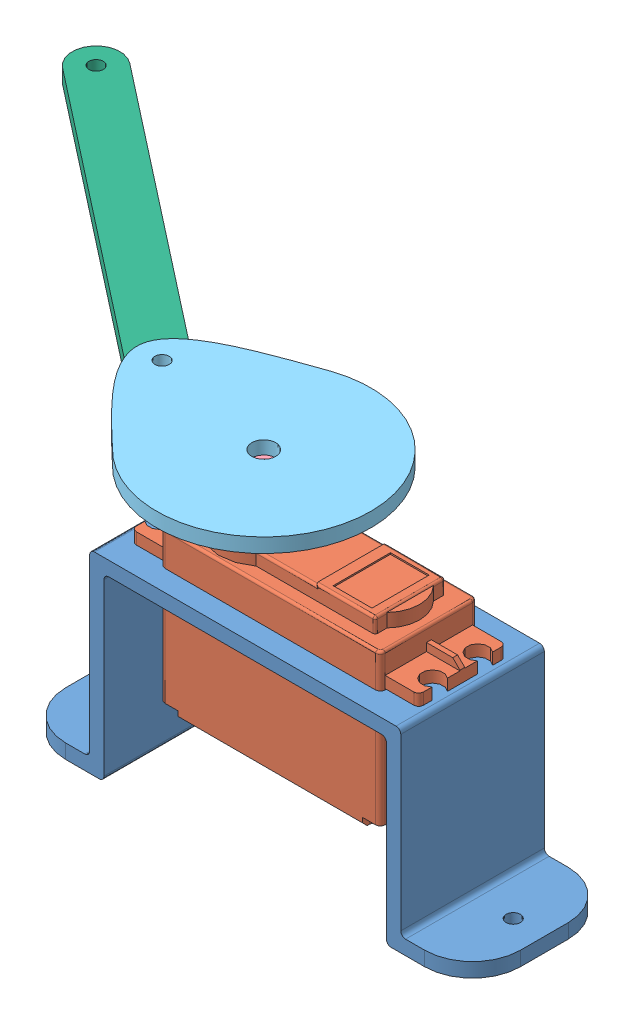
SolidWorks assembly Ass_servo_moteur.SLDASM, configuration Défaut (file format 3800). Lengths in mm.
Overall size (154.95 62.26 88.21).
7 component instances, 6 part files, 6 mates.
Components (placement in the parent):
- support_servo_moteur-1: support_servo_moteur.SLDPRT [Défaut] at (-99.5441 -25.3592 -15) size (95 40.56 30)
- SERVOMOTEUR-1: SERVOMOTEUR.SLDASM [Default] at (-40.8775 -5.6297 0.4339) x (0 0 -1) z (0 1 0) size (26.65 60 45.35)
  - CORPS SERVOMOT-1: CORPS SERVOMOT.SLDPRT [Default] at (10.0784 1.8594 -6.5815) size (20.25 60 38.35)
  - AXE SERVO-1: AXE SERVO.SLDPRT [Default] at (-0.0466 21.8105 26.7685) size (3 3 10)
  - VOLANT SERVO-1: VOLANT SERVO.SLDPRT [Default] at (-0.0466 21.8105 36.7685) x (0.993118 0.117118 0) z (0 0 -1) size (24 24 5.6)
- mecanisme_disque-1: mecanisme_disque.SLDPRT [Défaut] at (-62.688 33.8985 0.4805) x (0.979458 0 0.201651) z (0 -1 0) size (55 44.73 3)
- mecanisme_bras-1: mecanisme_bras.SLDPRT [Défaut] at (-159.4979 28.1198 -53.4315) x (0.787908 0 0.615793) z (0 1 0) size (90 10 3)
Mates (geometry in assembly coordinates):
- Parallèle1: parallel anti-aligned: plane of support_servo_moteur-1 through (-81.5441 -25.3592 15) normal (1 0 0); plane of SERVOMOTEUR-1/CORPS SERVOMOT-1 through (-74.198 19.3388 10.6055) normal (-1 0 0)
- Parallèle2: parallel aligned: plane of SERVOMOTEUR-1/CORPS SERVOMOT-1 through (-74.198 19.3388 10.6055) normal (0 0 1); line of support_servo_moteur-1
- Parallèle3: parallel aligned: plane of SERVOMOTEUR-1/CORPS SERVOMOT-1 through (-74.198 19.3388 10.6055) normal (0 0 1); plane of support_servo_moteur-1 through (-4.5441 -28.3592 15) normal (0 0 1)
- Parallèle4: parallel anti-aligned: plane of SERVOMOTEUR-1/VOLANT SERVO-1 through (-62.688 31.1388 0.4805) normal (0 1 0); plane of mecanisme_disque-1 through (-94.4397 30.8985 -6.6088) normal (0 -1 0)
- Coaxiale1: concentric anti-aligned: circle of SERVOMOTEUR-1/VOLANT SERVO-1; circle of mecanisme_disque-1
- Coaxiale4: concentric anti-aligned: circle of mecanisme_disque-1; circle of mecanisme_bras-1
